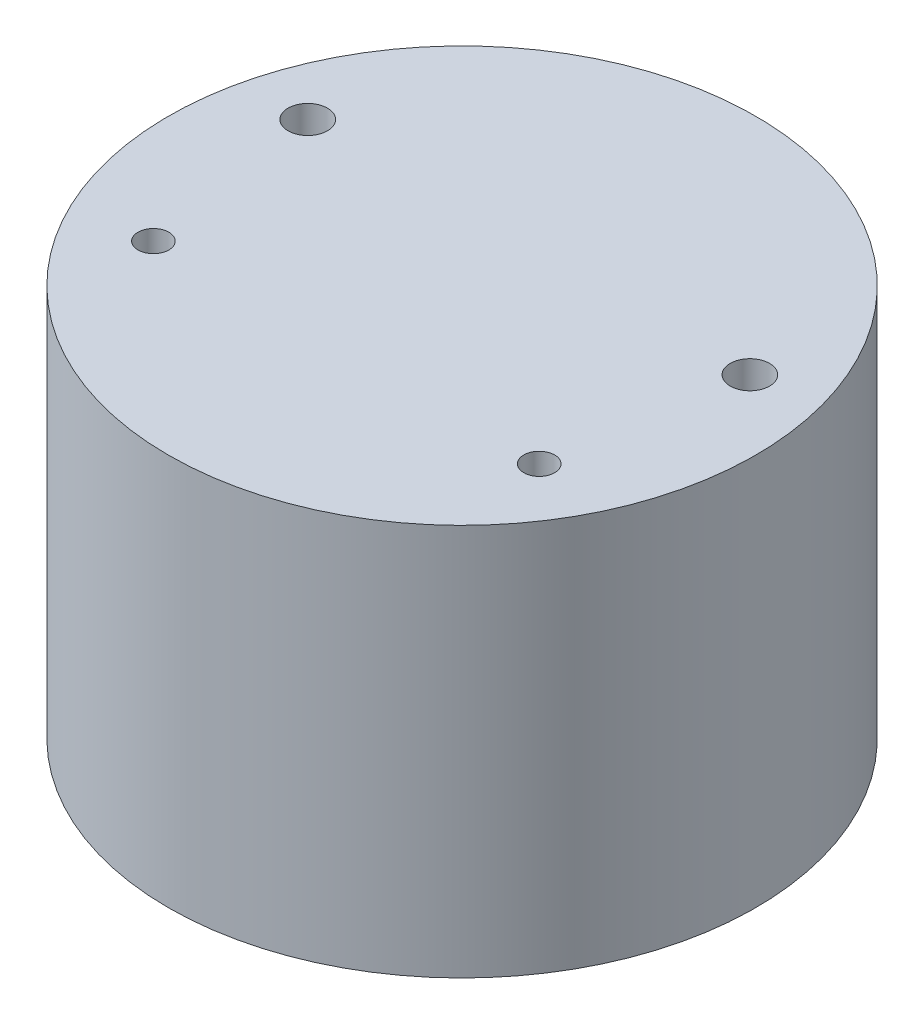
ISO-10303-21;
HEADER;
FILE_DESCRIPTION(('STEP AP214'),'2;1');
FILE_NAME('part.step','',(''),(''),'','','');
FILE_SCHEMA(('AUTOMOTIVE_DESIGN { 1 0 10303 214 1 1 1 1 }'));
ENDSEC;
DATA;
#1=APPLICATION_CONTEXT('core data for automotive mechanical design processes');
#2=APPLICATION_PROTOCOL_DEFINITION('international standard','automotive_design',2000,#1);
#3=PRODUCT_CONTEXT('',#1,'mechanical');
#4=PRODUCT('Part','Part','',(#3));
#5=PRODUCT_RELATED_PRODUCT_CATEGORY('part','',(#4));
#6=PRODUCT_DEFINITION_FORMATION('','',#4);
#7=PRODUCT_DEFINITION_CONTEXT('part definition',#1,'design');
#8=PRODUCT_DEFINITION('design','',#6,#7);
#9=PRODUCT_DEFINITION_SHAPE('','',#8);
#10=(LENGTH_UNIT() NAMED_UNIT(*) SI_UNIT(.MILLI.,.METRE.));
#11=(NAMED_UNIT(*) PLANE_ANGLE_UNIT() SI_UNIT($,.RADIAN.));
#12=(NAMED_UNIT(*) SI_UNIT($,.STERADIAN.) SOLID_ANGLE_UNIT());
#13=UNCERTAINTY_MEASURE_WITH_UNIT(LENGTH_MEASURE(1.E-05),#10,'distance_accuracy_value','');
#14=(GEOMETRIC_REPRESENTATION_CONTEXT(3) GLOBAL_UNCERTAINTY_ASSIGNED_CONTEXT((#13)) GLOBAL_UNIT_ASSIGNED_CONTEXT((#10,
#11,#12)) REPRESENTATION_CONTEXT('',''));
#15=CARTESIAN_POINT('',(0.,0.,0.));
#16=DIRECTION('',(0.,0.,1.));
#17=DIRECTION('',(1.,0.,0.));
#18=AXIS2_PLACEMENT_3D('',#15,#16,#17);
#19=CARTESIAN_POINT('',(0.,50.8,0.));
#20=DIRECTION('',(0.,-1.,0.));
#21=DIRECTION('',(0.,0.,-1.));
#22=AXIS2_PLACEMENT_3D('',#19,#20,#21);
#23=CYLINDRICAL_SURFACE('',#22,38.05);
#24=CARTESIAN_POINT('',(0.,50.8,0.));
#25=DIRECTION('',(0.,1.,0.));
#26=DIRECTION('',(0.,0.,1.));
#27=AXIS2_PLACEMENT_3D('',#24,#25,#26);
#28=CIRCLE('',#27,38.05);
#29=CARTESIAN_POINT('',(0.,50.8,38.05));
#30=VERTEX_POINT('',#29);
#31=EDGE_CURVE('E11',#30,#30,#28,.T.);
#32=ORIENTED_EDGE('',*,*,#31,.F.);
#33=EDGE_LOOP('',(#32));
#34=FACE_BOUND('',#33,.T.);
#35=CARTESIAN_POINT('',(0.,0.,0.));
#36=DIRECTION('',(0.,1.,0.));
#37=DIRECTION('',(0.,0.,1.));
#38=AXIS2_PLACEMENT_3D('',#35,#36,#37);
#39=CIRCLE('',#38,38.05);
#40=CARTESIAN_POINT('',(0.,0.,38.05));
#41=VERTEX_POINT('',#40);
#42=EDGE_CURVE('E39',#41,#41,#39,.T.);
#43=ORIENTED_EDGE('',*,*,#42,.T.);
#44=EDGE_LOOP('',(#43));
#45=FACE_BOUND('',#44,.T.);
#46=ADVANCED_FACE('F36',(#34,#45),#23,.T.);
#47=CARTESIAN_POINT('',(0.,50.8,0.));
#48=DIRECTION('',(0.,1.,0.));
#49=DIRECTION('',(0.,0.,1.));
#50=AXIS2_PLACEMENT_3D('',#47,#48,#49);
#51=PLANE('',#50);
#52=CARTESIAN_POINT('',(-25.,50.8,15.));
#53=DIRECTION('',(0.,1.,0.));
#54=DIRECTION('',(0.,0.,1.));
#55=AXIS2_PLACEMENT_3D('',#52,#53,#54);
#56=CIRCLE('',#55,2.);
#57=CARTESIAN_POINT('',(-25.,50.8,17.));
#58=VERTEX_POINT('',#57);
#59=EDGE_CURVE('E193',#58,#58,#56,.T.);
#60=ORIENTED_EDGE('',*,*,#59,.F.);
#61=EDGE_LOOP('',(#60));
#62=FACE_BOUND('',#61,.T.);
#63=CARTESIAN_POINT('',(25.,50.8,15.));
#64=DIRECTION('',(0.,1.,0.));
#65=DIRECTION('',(0.,0.,1.));
#66=AXIS2_PLACEMENT_3D('',#63,#64,#65);
#67=CIRCLE('',#66,2.);
#68=CARTESIAN_POINT('',(25.,50.8,17.));
#69=VERTEX_POINT('',#68);
#70=EDGE_CURVE('E192',#69,#69,#67,.T.);
#71=ORIENTED_EDGE('',*,*,#70,.F.);
#72=EDGE_LOOP('',(#71));
#73=FACE_BOUND('',#72,.T.);
#74=CARTESIAN_POINT('',(-28.65,50.8,-8.65));
#75=DIRECTION('',(0.,1.,0.));
#76=DIRECTION('',(0.,0.,1.));
#77=AXIS2_PLACEMENT_3D('',#74,#75,#76);
#78=CIRCLE('',#77,2.5527);
#79=CARTESIAN_POINT('',(-28.65,50.8,-6.0973));
#80=VERTEX_POINT('',#79);
#81=EDGE_CURVE('E60',#80,#80,#78,.T.);
#82=ORIENTED_EDGE('',*,*,#81,.F.);
#83=EDGE_LOOP('',(#82));
#84=FACE_BOUND('',#83,.T.);
#85=CARTESIAN_POINT('',(28.65,50.8,-8.65));
#86=DIRECTION('',(0.,1.,0.));
#87=DIRECTION('',(0.,0.,1.));
#88=AXIS2_PLACEMENT_3D('',#85,#86,#87);
#89=CIRCLE('',#88,2.5527);
#90=CARTESIAN_POINT('',(28.65,50.8,-6.0973));
#91=VERTEX_POINT('',#90);
#92=EDGE_CURVE('E59',#91,#91,#89,.T.);
#93=ORIENTED_EDGE('',*,*,#92,.F.);
#94=EDGE_LOOP('',(#93));
#95=FACE_BOUND('',#94,.T.);
#96=ORIENTED_EDGE('',*,*,#31,.T.);
#97=EDGE_LOOP('',(#96));
#98=FACE_BOUND('',#97,.T.);
#99=ADVANCED_FACE('F80',(#62,#73,#84,#95,#98),#51,.T.);
#100=CARTESIAN_POINT('',(0.,0.,0.));
#101=DIRECTION('',(0.,1.,0.));
#102=DIRECTION('',(0.,0.,1.));
#103=AXIS2_PLACEMENT_3D('',#100,#101,#102);
#104=PLANE('',#103);
#105=ORIENTED_EDGE('',*,*,#42,.F.);
#106=EDGE_LOOP('',(#105));
#107=FACE_BOUND('',#106,.T.);
#108=ADVANCED_FACE('F77',(#107),#104,.F.);
#109=CARTESIAN_POINT('',(28.65,34.29,-8.65));
#110=DIRECTION('',(0.,1.,0.));
#111=DIRECTION('',(0.,0.,1.));
#112=AXIS2_PLACEMENT_3D('',#109,#110,#111);
#113=CONICAL_SURFACE('',#112,2.5527,1.02974425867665);
#114=CARTESIAN_POINT('',(28.65,32.7561830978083,-8.65));
#115=VERTEX_POINT('',#114);
#116=VERTEX_LOOP('',#115);
#117=FACE_BOUND('',#116,.T.);
#118=CARTESIAN_POINT('',(28.65,34.29,-8.65));
#119=DIRECTION('',(0.,1.,0.));
#120=DIRECTION('',(0.,0.,1.));
#121=AXIS2_PLACEMENT_3D('',#118,#119,#120);
#122=CIRCLE('',#121,2.5527);
#123=CARTESIAN_POINT('',(28.65,34.29,-6.0973));
#124=VERTEX_POINT('',#123);
#125=EDGE_CURVE('E63',#124,#124,#122,.T.);
#126=ORIENTED_EDGE('',*,*,#125,.T.);
#127=EDGE_LOOP('',(#126));
#128=FACE_BOUND('',#127,.T.);
#129=ADVANCED_FACE('F79',(#117,#128),#113,.F.);
#130=CARTESIAN_POINT('',(28.65,50.8,-8.65));
#131=DIRECTION('',(0.,1.,0.));
#132=DIRECTION('',(0.,0.,1.));
#133=AXIS2_PLACEMENT_3D('',#130,#131,#132);
#134=CYLINDRICAL_SURFACE('',#133,2.5527);
#135=ORIENTED_EDGE('',*,*,#125,.F.);
#136=EDGE_LOOP('',(#135));
#137=FACE_BOUND('',#136,.T.);
#138=ORIENTED_EDGE('',*,*,#92,.T.);
#139=EDGE_LOOP('',(#138));
#140=FACE_BOUND('',#139,.T.);
#141=ADVANCED_FACE('F53',(#137,#140),#134,.F.);
#142=CARTESIAN_POINT('',(-28.65,34.29,-8.65));
#143=DIRECTION('',(0.,1.,0.));
#144=DIRECTION('',(0.,0.,1.));
#145=AXIS2_PLACEMENT_3D('',#142,#143,#144);
#146=CONICAL_SURFACE('',#145,2.5527,1.02974425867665);
#147=CARTESIAN_POINT('',(-28.65,32.7561830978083,-8.65));
#148=VERTEX_POINT('',#147);
#149=VERTEX_LOOP('',#148);
#150=FACE_BOUND('',#149,.T.);
#151=CARTESIAN_POINT('',(-28.65,34.29,-8.65));
#152=DIRECTION('',(0.,1.,0.));
#153=DIRECTION('',(0.,0.,1.));
#154=AXIS2_PLACEMENT_3D('',#151,#152,#153);
#155=CIRCLE('',#154,2.5527);
#156=CARTESIAN_POINT('',(-28.65,34.29,-6.0973));
#157=VERTEX_POINT('',#156);
#158=EDGE_CURVE('E57',#157,#157,#155,.T.);
#159=ORIENTED_EDGE('',*,*,#158,.T.);
#160=EDGE_LOOP('',(#159));
#161=FACE_BOUND('',#160,.T.);
#162=ADVANCED_FACE('F49',(#150,#161),#146,.F.);
#163=CARTESIAN_POINT('',(-28.65,50.8,-8.65));
#164=DIRECTION('',(0.,1.,0.));
#165=DIRECTION('',(0.,0.,1.));
#166=AXIS2_PLACEMENT_3D('',#163,#164,#165);
#167=CYLINDRICAL_SURFACE('',#166,2.5527);
#168=ORIENTED_EDGE('',*,*,#158,.F.);
#169=EDGE_LOOP('',(#168));
#170=FACE_BOUND('',#169,.T.);
#171=ORIENTED_EDGE('',*,*,#81,.T.);
#172=EDGE_LOOP('',(#171));
#173=FACE_BOUND('',#172,.T.);
#174=ADVANCED_FACE('F52',(#170,#173),#167,.F.);
#175=CARTESIAN_POINT('',(25.,40.8,15.));
#176=DIRECTION('',(0.,1.,0.));
#177=DIRECTION('',(0.,0.,1.));
#178=AXIS2_PLACEMENT_3D('',#175,#176,#177);
#179=CYLINDRICAL_SURFACE('',#178,2.);
#180=CARTESIAN_POINT('',(25.,40.8,15.));
#181=DIRECTION('',(0.,1.,0.));
#182=DIRECTION('',(0.,0.,1.));
#183=AXIS2_PLACEMENT_3D('',#180,#181,#182);
#184=CIRCLE('',#183,2.);
#185=CARTESIAN_POINT('',(25.,40.8,17.));
#186=VERTEX_POINT('',#185);
#187=EDGE_CURVE('E66',#186,#186,#184,.T.);
#188=ORIENTED_EDGE('',*,*,#187,.F.);
#189=EDGE_LOOP('',(#188));
#190=FACE_BOUND('',#189,.T.);
#191=ORIENTED_EDGE('',*,*,#70,.T.);
#192=EDGE_LOOP('',(#191));
#193=FACE_BOUND('',#192,.T.);
#194=ADVANCED_FACE('F109',(#190,#193),#179,.F.);
#195=CARTESIAN_POINT('',(25.,40.8,15.));
#196=DIRECTION('',(0.,1.,0.));
#197=DIRECTION('',(0.,0.,1.));
#198=AXIS2_PLACEMENT_3D('',#195,#196,#197);
#199=PLANE('',#198);
#200=ORIENTED_EDGE('',*,*,#187,.T.);
#201=EDGE_LOOP('',(#200));
#202=FACE_BOUND('',#201,.T.);
#203=ADVANCED_FACE('F114',(#202),#199,.T.);
#204=CARTESIAN_POINT('',(-25.,40.8,15.));
#205=DIRECTION('',(0.,1.,0.));
#206=DIRECTION('',(0.,0.,1.));
#207=AXIS2_PLACEMENT_3D('',#204,#205,#206);
#208=CYLINDRICAL_SURFACE('',#207,2.);
#209=CARTESIAN_POINT('',(-25.,40.8,15.));
#210=DIRECTION('',(0.,1.,0.));
#211=DIRECTION('',(0.,0.,1.));
#212=AXIS2_PLACEMENT_3D('',#209,#210,#211);
#213=CIRCLE('',#212,2.);
#214=CARTESIAN_POINT('',(-25.,40.8,17.));
#215=VERTEX_POINT('',#214);
#216=EDGE_CURVE('E191',#215,#215,#213,.T.);
#217=ORIENTED_EDGE('',*,*,#216,.F.);
#218=EDGE_LOOP('',(#217));
#219=FACE_BOUND('',#218,.T.);
#220=ORIENTED_EDGE('',*,*,#59,.T.);
#221=EDGE_LOOP('',(#220));
#222=FACE_BOUND('',#221,.T.);
#223=ADVANCED_FACE('F125',(#219,#222),#208,.F.);
#224=CARTESIAN_POINT('',(-25.,40.8,15.));
#225=DIRECTION('',(0.,1.,0.));
#226=DIRECTION('',(0.,0.,1.));
#227=AXIS2_PLACEMENT_3D('',#224,#225,#226);
#228=PLANE('',#227);
#229=ORIENTED_EDGE('',*,*,#216,.T.);
#230=EDGE_LOOP('',(#229));
#231=FACE_BOUND('',#230,.T.);
#232=ADVANCED_FACE('F135',(#231),#228,.T.);
#233=CLOSED_SHELL('',(#46,#99,#108,#129,#141,#162,#174,#194,#203,#223,#232));
#234=MANIFOLD_SOLID_BREP('B2',#233);
#235=ADVANCED_BREP_SHAPE_REPRESENTATION('',(#18,#234),#14);
#236=SHAPE_DEFINITION_REPRESENTATION(#9,#235);
ENDSEC;
END-ISO-10303-21;
